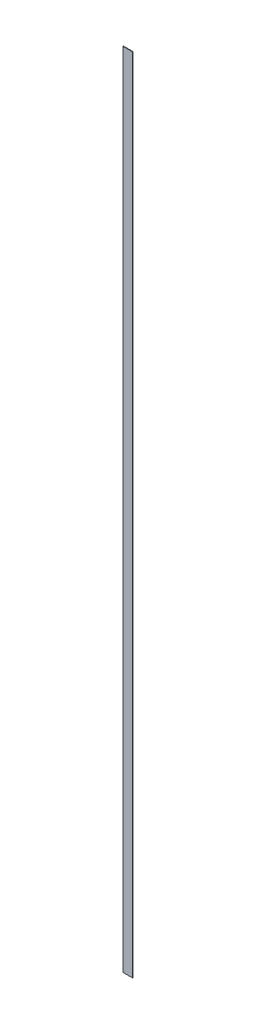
ISO-10303-21;
HEADER;
FILE_DESCRIPTION(('STEP AP214'),'2;1');
FILE_NAME('part.step','',(''),(''),'','','');
FILE_SCHEMA(('AUTOMOTIVE_DESIGN { 1 0 10303 214 1 1 1 1 }'));
ENDSEC;
DATA;
#1=APPLICATION_CONTEXT('core data for automotive mechanical design processes');
#2=APPLICATION_PROTOCOL_DEFINITION('international standard','automotive_design',2000,#1);
#3=PRODUCT_CONTEXT('',#1,'mechanical');
#4=PRODUCT('Part','Part','',(#3));
#5=PRODUCT_RELATED_PRODUCT_CATEGORY('part','',(#4));
#6=PRODUCT_DEFINITION_FORMATION('','',#4);
#7=PRODUCT_DEFINITION_CONTEXT('part definition',#1,'design');
#8=PRODUCT_DEFINITION('design','',#6,#7);
#9=PRODUCT_DEFINITION_SHAPE('','',#8);
#10=(LENGTH_UNIT() NAMED_UNIT(*) SI_UNIT(.MILLI.,.METRE.));
#11=(NAMED_UNIT(*) PLANE_ANGLE_UNIT() SI_UNIT($,.RADIAN.));
#12=(NAMED_UNIT(*) SI_UNIT($,.STERADIAN.) SOLID_ANGLE_UNIT());
#13=UNCERTAINTY_MEASURE_WITH_UNIT(LENGTH_MEASURE(1.E-05),#10,'distance_accuracy_value','');
#14=(GEOMETRIC_REPRESENTATION_CONTEXT(3) GLOBAL_UNCERTAINTY_ASSIGNED_CONTEXT((#13)) GLOBAL_UNIT_ASSIGNED_CONTEXT((#10,
#11,#12)) REPRESENTATION_CONTEXT('',''));
#15=CARTESIAN_POINT('',(0.,0.,0.));
#16=DIRECTION('',(0.,0.,1.));
#17=DIRECTION('',(1.,0.,0.));
#18=AXIS2_PLACEMENT_3D('',#15,#16,#17);
#19=CARTESIAN_POINT('',(-97.6985838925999,969.6,1.19999999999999));
#20=DIRECTION('',(0.,1.,0.));
#21=DIRECTION('',(1.,0.,0.));
#22=AXIS2_PLACEMENT_3D('',#19,#20,#21);
#23=PLANE('',#22);
#24=DIRECTION('',(1.,0.,0.));
#25=VECTOR('',#24,1.);
#26=CARTESIAN_POINT('',(-97.6985838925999,969.6,1.19999999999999));
#27=LINE('',#26,#25);
#28=CARTESIAN_POINT('',(-111.4985838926,969.6,1.20000000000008));
#29=VERTEX_POINT('',#28);
#30=CARTESIAN_POINT('',(-87.9999999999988,969.6,1.2));
#31=VERTEX_POINT('',#30);
#32=EDGE_CURVE('E101',#29,#31,#27,.T.);
#33=ORIENTED_EDGE('',*,*,#32,.T.);
#34=DIRECTION('',(0.,0.,-1.));
#35=VECTOR('',#34,1.);
#36=CARTESIAN_POINT('',(-87.9999999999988,969.6,1.2));
#37=LINE('',#36,#35);
#38=CARTESIAN_POINT('',(-87.9999999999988,969.6,0.));
#39=VERTEX_POINT('',#38);
#40=EDGE_CURVE('E130',#31,#39,#37,.T.);
#41=ORIENTED_EDGE('',*,*,#40,.T.);
#42=DIRECTION('',(-1.,0.,0.));
#43=VECTOR('',#42,1.);
#44=CARTESIAN_POINT('',(-97.6985838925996,969.6,0.));
#45=LINE('',#44,#43);
#46=CARTESIAN_POINT('',(-111.4985838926,969.6,0.));
#47=VERTEX_POINT('',#46);
#48=EDGE_CURVE('E120',#47,#39,#45,.F.);
#49=ORIENTED_EDGE('',*,*,#48,.F.);
#50=DIRECTION('',(0.,0.,-1.));
#51=VECTOR('',#50,1.);
#52=CARTESIAN_POINT('',(-111.4985838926,969.6,1.20000000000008));
#53=LINE('',#52,#51);
#54=EDGE_CURVE('E13',#29,#47,#53,.T.);
#55=ORIENTED_EDGE('',*,*,#54,.F.);
#56=EDGE_LOOP('',(#33,#41,#49,#55));
#57=FACE_BOUND('',#56,.T.);
#58=ADVANCED_FACE('F62',(#57),#23,.T.);
#59=CARTESIAN_POINT('',(-111.4985838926,-970.999999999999,1.20000000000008));
#60=DIRECTION('',(0.,-1.,0.));
#61=DIRECTION('',(-1.,0.,0.));
#62=AXIS2_PLACEMENT_3D('',#59,#60,#61);
#63=PLANE('',#62);
#64=DIRECTION('',(1.,0.,0.));
#65=VECTOR('',#64,1.);
#66=CARTESIAN_POINT('',(-97.6985838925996,-970.999999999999,0.));
#67=LINE('',#66,#65);
#68=CARTESIAN_POINT('',(-87.9999999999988,-970.999999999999,0.));
#69=VERTEX_POINT('',#68);
#70=CARTESIAN_POINT('',(-111.4985838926,-970.999999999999,0.));
#71=VERTEX_POINT('',#70);
#72=EDGE_CURVE('E66',#69,#71,#67,.F.);
#73=ORIENTED_EDGE('',*,*,#72,.F.);
#74=DIRECTION('',(0.,0.,-1.));
#75=VECTOR('',#74,1.);
#76=CARTESIAN_POINT('',(-87.9999999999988,-970.999999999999,1.2));
#77=LINE('',#76,#75);
#78=CARTESIAN_POINT('',(-87.9999999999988,-970.999999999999,1.2));
#79=VERTEX_POINT('',#78);
#80=EDGE_CURVE('E122',#79,#69,#77,.T.);
#81=ORIENTED_EDGE('',*,*,#80,.F.);
#82=DIRECTION('',(-1.,0.,0.));
#83=VECTOR('',#82,1.);
#84=CARTESIAN_POINT('',(-111.4985838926,-970.999999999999,1.20000000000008));
#85=LINE('',#84,#83);
#86=CARTESIAN_POINT('',(-111.4985838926,-970.999999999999,1.20000000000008));
#87=VERTEX_POINT('',#86);
#88=EDGE_CURVE('E112',#79,#87,#85,.T.);
#89=ORIENTED_EDGE('',*,*,#88,.T.);
#90=DIRECTION('',(0.,0.,-1.));
#91=VECTOR('',#90,1.);
#92=CARTESIAN_POINT('',(-111.4985838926,-970.999999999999,1.20000000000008));
#93=LINE('',#92,#91);
#94=EDGE_CURVE('E73',#87,#71,#93,.T.);
#95=ORIENTED_EDGE('',*,*,#94,.T.);
#96=EDGE_LOOP('',(#73,#81,#89,#95));
#97=FACE_BOUND('',#96,.T.);
#98=ADVANCED_FACE('F123',(#97),#63,.T.);
#99=CARTESIAN_POINT('',(-97.6985838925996,0.,1.19999999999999));
#100=DIRECTION('',(0.,0.,1.));
#101=DIRECTION('',(1.,0.,0.));
#102=AXIS2_PLACEMENT_3D('',#99,#100,#101);
#103=PLANE('',#102);
#104=ORIENTED_EDGE('',*,*,#88,.F.);
#105=DIRECTION('',(0.,1.,0.));
#106=VECTOR('',#105,1.);
#107=CARTESIAN_POINT('',(-87.9999999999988,-970.999999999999,1.2));
#108=LINE('',#107,#106);
#109=EDGE_CURVE('E115',#79,#31,#108,.T.);
#110=ORIENTED_EDGE('',*,*,#109,.T.);
#111=ORIENTED_EDGE('',*,*,#32,.F.);
#112=DIRECTION('',(0.,1.,0.));
#113=VECTOR('',#112,1.);
#114=CARTESIAN_POINT('',(-111.4985838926,969.6,1.20000000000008));
#115=LINE('',#114,#113);
#116=EDGE_CURVE('E117',#87,#29,#115,.T.);
#117=ORIENTED_EDGE('',*,*,#116,.F.);
#118=EDGE_LOOP('',(#104,#110,#111,#117));
#119=FACE_BOUND('',#118,.T.);
#120=ADVANCED_FACE('F113',(#119),#103,.T.);
#121=CARTESIAN_POINT('',(0.,0.,0.));
#122=DIRECTION('',(0.,0.,1.));
#123=DIRECTION('',(1.,0.,0.));
#124=AXIS2_PLACEMENT_3D('',#121,#122,#123);
#125=PLANE('',#124);
#126=ORIENTED_EDGE('',*,*,#48,.T.);
#127=DIRECTION('',(0.,1.,0.));
#128=VECTOR('',#127,1.);
#129=CARTESIAN_POINT('',(-87.9999999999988,-970.999999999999,0.));
#130=LINE('',#129,#128);
#131=EDGE_CURVE('E127',#69,#39,#130,.T.);
#132=ORIENTED_EDGE('',*,*,#131,.F.);
#133=ORIENTED_EDGE('',*,*,#72,.T.);
#134=DIRECTION('',(0.,-1.,0.));
#135=VECTOR('',#134,1.);
#136=CARTESIAN_POINT('',(-111.4985838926,0.,0.));
#137=LINE('',#136,#135);
#138=EDGE_CURVE('E146',#71,#47,#137,.F.);
#139=ORIENTED_EDGE('',*,*,#138,.T.);
#140=EDGE_LOOP('',(#126,#132,#133,#139));
#141=FACE_BOUND('',#140,.T.);
#142=ADVANCED_FACE('F64',(#141),#125,.F.);
#143=CARTESIAN_POINT('',(-111.4985838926,969.6,1.20000000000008));
#144=DIRECTION('',(-1.,0.,0.));
#145=DIRECTION('',(0.,0.,1.));
#146=AXIS2_PLACEMENT_3D('',#143,#144,#145);
#147=PLANE('',#146);
#148=ORIENTED_EDGE('',*,*,#138,.F.);
#149=ORIENTED_EDGE('',*,*,#94,.F.);
#150=ORIENTED_EDGE('',*,*,#116,.T.);
#151=ORIENTED_EDGE('',*,*,#54,.T.);
#152=EDGE_LOOP('',(#148,#149,#150,#151));
#153=FACE_BOUND('',#152,.T.);
#154=ADVANCED_FACE('F160',(#153),#147,.T.);
#155=CARTESIAN_POINT('',(-87.9999999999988,-970.999999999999,1.2));
#156=DIRECTION('',(-1.,0.,0.));
#157=DIRECTION('',(0.,0.,1.));
#158=AXIS2_PLACEMENT_3D('',#155,#156,#157);
#159=PLANE('',#158);
#160=ORIENTED_EDGE('',*,*,#131,.T.);
#161=ORIENTED_EDGE('',*,*,#40,.F.);
#162=ORIENTED_EDGE('',*,*,#109,.F.);
#163=ORIENTED_EDGE('',*,*,#80,.T.);
#164=EDGE_LOOP('',(#160,#161,#162,#163));
#165=FACE_BOUND('',#164,.T.);
#166=ADVANCED_FACE('F129',(#165),#159,.F.);
#167=CLOSED_SHELL('',(#58,#98,#120,#142,#154,#166));
#168=MANIFOLD_SOLID_BREP('B2',#167);
#169=ADVANCED_BREP_SHAPE_REPRESENTATION('',(#18,#168),#14);
#170=SHAPE_DEFINITION_REPRESENTATION(#9,#169);
ENDSEC;
END-ISO-10303-21;
